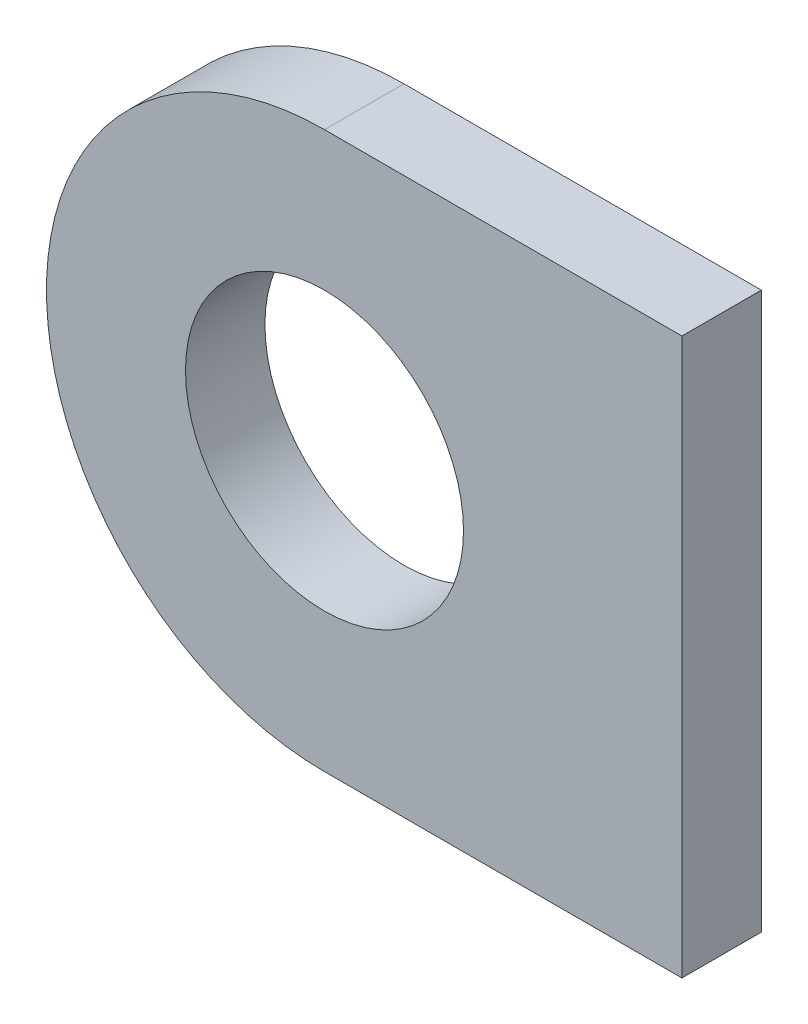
ISO-10303-21;
HEADER;
FILE_DESCRIPTION(('STEP AP214'),'2;1');
FILE_NAME('part.step','',(''),(''),'','','');
FILE_SCHEMA(('AUTOMOTIVE_DESIGN { 1 0 10303 214 1 1 1 1 }'));
ENDSEC;
DATA;
#1=APPLICATION_CONTEXT('core data for automotive mechanical design processes');
#2=APPLICATION_PROTOCOL_DEFINITION('international standard','automotive_design',2000,#1);
#3=PRODUCT_CONTEXT('',#1,'mechanical');
#4=PRODUCT('Part','Part','',(#3));
#5=PRODUCT_RELATED_PRODUCT_CATEGORY('part','',(#4));
#6=PRODUCT_DEFINITION_FORMATION('','',#4);
#7=PRODUCT_DEFINITION_CONTEXT('part definition',#1,'design');
#8=PRODUCT_DEFINITION('design','',#6,#7);
#9=PRODUCT_DEFINITION_SHAPE('','',#8);
#10=(LENGTH_UNIT() NAMED_UNIT(*) SI_UNIT(.MILLI.,.METRE.));
#11=(NAMED_UNIT(*) PLANE_ANGLE_UNIT() SI_UNIT($,.RADIAN.));
#12=(NAMED_UNIT(*) SI_UNIT($,.STERADIAN.) SOLID_ANGLE_UNIT());
#13=UNCERTAINTY_MEASURE_WITH_UNIT(LENGTH_MEASURE(1.E-05),#10,'distance_accuracy_value','');
#14=(GEOMETRIC_REPRESENTATION_CONTEXT(3) GLOBAL_UNCERTAINTY_ASSIGNED_CONTEXT((#13)) GLOBAL_UNIT_ASSIGNED_CONTEXT((#10,
#11,#12)) REPRESENTATION_CONTEXT('',''));
#15=CARTESIAN_POINT('',(0.,0.,0.));
#16=DIRECTION('',(0.,0.,1.));
#17=DIRECTION('',(1.,0.,0.));
#18=AXIS2_PLACEMENT_3D('',#15,#16,#17);
#19=CARTESIAN_POINT('',(-45.,-35.,10.));
#20=DIRECTION('',(0.,0.,-1.));
#21=DIRECTION('',(-1.,0.,0.));
#22=AXIS2_PLACEMENT_3D('',#19,#20,#21);
#23=PLANE('',#22);
#24=DIRECTION('',(0.,1.,0.));
#25=VECTOR('',#24,1.);
#26=CARTESIAN_POINT('',(0.,0.,10.));
#27=LINE('',#26,#25);
#28=CARTESIAN_POINT('',(0.,-70.,10.));
#29=VERTEX_POINT('',#28);
#30=CARTESIAN_POINT('',(0.,0.,10.));
#31=VERTEX_POINT('',#30);
#32=EDGE_CURVE('E84',#29,#31,#27,.T.);
#33=ORIENTED_EDGE('',*,*,#32,.T.);
#34=DIRECTION('',(-1.,0.,0.));
#35=VECTOR('',#34,1.);
#36=CARTESIAN_POINT('',(0.,0.,10.));
#37=LINE('',#36,#35);
#38=CARTESIAN_POINT('',(-45.,0.,10.));
#39=VERTEX_POINT('',#38);
#40=EDGE_CURVE('E79',#31,#39,#37,.T.);
#41=ORIENTED_EDGE('',*,*,#40,.T.);
#42=CARTESIAN_POINT('',(-45.,-35.,10.));
#43=DIRECTION('',(0.,0.,1.));
#44=DIRECTION('',(-1.,0.,0.));
#45=AXIS2_PLACEMENT_3D('',#42,#43,#44);
#46=CIRCLE('',#45,35.);
#47=CARTESIAN_POINT('',(-45.,-70.,10.));
#48=VERTEX_POINT('',#47);
#49=EDGE_CURVE('E82',#39,#48,#46,.T.);
#50=ORIENTED_EDGE('',*,*,#49,.T.);
#51=DIRECTION('',(1.,0.,0.));
#52=VECTOR('',#51,1.);
#53=CARTESIAN_POINT('',(0.,-70.,10.));
#54=LINE('',#53,#52);
#55=EDGE_CURVE('E49',#48,#29,#54,.T.);
#56=ORIENTED_EDGE('',*,*,#55,.T.);
#57=EDGE_LOOP('',(#33,#41,#50,#56));
#58=FACE_BOUND('',#57,.T.);
#59=CARTESIAN_POINT('',(-45.,-35.,10.));
#60=DIRECTION('',(0.,0.,1.));
#61=DIRECTION('',(1.,0.,0.));
#62=AXIS2_PLACEMENT_3D('',#59,#60,#61);
#63=CIRCLE('',#62,17.5);
#64=CARTESIAN_POINT('',(-27.5,-35.,10.));
#65=VERTEX_POINT('',#64);
#66=EDGE_CURVE('E99',#65,#65,#63,.T.);
#67=ORIENTED_EDGE('',*,*,#66,.F.);
#68=EDGE_LOOP('',(#67));
#69=FACE_BOUND('',#68,.T.);
#70=ADVANCED_FACE('F32',(#58,#69),#23,.F.);
#71=CARTESIAN_POINT('',(-45.,-35.,0.));
#72=DIRECTION('',(0.,0.,-1.));
#73=DIRECTION('',(-1.,0.,0.));
#74=AXIS2_PLACEMENT_3D('',#71,#72,#73);
#75=PLANE('',#74);
#76=DIRECTION('',(0.,1.,0.));
#77=VECTOR('',#76,1.);
#78=CARTESIAN_POINT('',(0.,0.,0.));
#79=LINE('',#78,#77);
#80=CARTESIAN_POINT('',(0.,-70.,0.));
#81=VERTEX_POINT('',#80);
#82=CARTESIAN_POINT('',(0.,0.,0.));
#83=VERTEX_POINT('',#82);
#84=EDGE_CURVE('E96',#81,#83,#79,.T.);
#85=ORIENTED_EDGE('',*,*,#84,.F.);
#86=DIRECTION('',(1.,0.,0.));
#87=VECTOR('',#86,1.);
#88=CARTESIAN_POINT('',(0.,-70.,0.));
#89=LINE('',#88,#87);
#90=CARTESIAN_POINT('',(-45.,-70.,0.));
#91=VERTEX_POINT('',#90);
#92=EDGE_CURVE('E72',#91,#81,#89,.T.);
#93=ORIENTED_EDGE('',*,*,#92,.F.);
#94=CARTESIAN_POINT('',(-45.,-35.,0.));
#95=DIRECTION('',(0.,0.,1.));
#96=DIRECTION('',(-1.,0.,0.));
#97=AXIS2_PLACEMENT_3D('',#94,#95,#96);
#98=CIRCLE('',#97,35.);
#99=CARTESIAN_POINT('',(-45.,0.,0.));
#100=VERTEX_POINT('',#99);
#101=EDGE_CURVE('E66',#100,#91,#98,.T.);
#102=ORIENTED_EDGE('',*,*,#101,.F.);
#103=DIRECTION('',(-1.,0.,0.));
#104=VECTOR('',#103,1.);
#105=CARTESIAN_POINT('',(0.,0.,0.));
#106=LINE('',#105,#104);
#107=EDGE_CURVE('E88',#83,#100,#106,.T.);
#108=ORIENTED_EDGE('',*,*,#107,.F.);
#109=EDGE_LOOP('',(#85,#93,#102,#108));
#110=FACE_BOUND('',#109,.T.);
#111=CARTESIAN_POINT('',(-45.,-35.,0.));
#112=DIRECTION('',(0.,0.,1.));
#113=DIRECTION('',(1.,0.,0.));
#114=AXIS2_PLACEMENT_3D('',#111,#112,#113);
#115=CIRCLE('',#114,17.5);
#116=CARTESIAN_POINT('',(-27.5,-35.,0.));
#117=VERTEX_POINT('',#116);
#118=EDGE_CURVE('E111',#117,#117,#115,.T.);
#119=ORIENTED_EDGE('',*,*,#118,.T.);
#120=EDGE_LOOP('',(#119));
#121=FACE_BOUND('',#120,.T.);
#122=ADVANCED_FACE('F107',(#110,#121),#75,.T.);
#123=CARTESIAN_POINT('',(0.,0.,10.));
#124=DIRECTION('',(-1.,0.,0.));
#125=DIRECTION('',(0.,-1.,0.));
#126=AXIS2_PLACEMENT_3D('',#123,#124,#125);
#127=PLANE('',#126);
#128=ORIENTED_EDGE('',*,*,#84,.T.);
#129=DIRECTION('',(0.,0.,-1.));
#130=VECTOR('',#129,1.);
#131=CARTESIAN_POINT('',(0.,0.,10.));
#132=LINE('',#131,#130);
#133=EDGE_CURVE('E11',#31,#83,#132,.T.);
#134=ORIENTED_EDGE('',*,*,#133,.F.);
#135=ORIENTED_EDGE('',*,*,#32,.F.);
#136=DIRECTION('',(0.,0.,-1.));
#137=VECTOR('',#136,1.);
#138=CARTESIAN_POINT('',(0.,-70.,10.));
#139=LINE('',#138,#137);
#140=EDGE_CURVE('E92',#29,#81,#139,.T.);
#141=ORIENTED_EDGE('',*,*,#140,.T.);
#142=EDGE_LOOP('',(#128,#134,#135,#141));
#143=FACE_BOUND('',#142,.T.);
#144=ADVANCED_FACE('F34',(#143),#127,.F.);
#145=CARTESIAN_POINT('',(0.,0.,10.));
#146=DIRECTION('',(0.,-1.,0.));
#147=DIRECTION('',(1.,0.,0.));
#148=AXIS2_PLACEMENT_3D('',#145,#146,#147);
#149=PLANE('',#148);
#150=ORIENTED_EDGE('',*,*,#107,.T.);
#151=DIRECTION('',(0.,0.,-1.));
#152=VECTOR('',#151,1.);
#153=CARTESIAN_POINT('',(-45.,0.,10.));
#154=LINE('',#153,#152);
#155=EDGE_CURVE('E41',#39,#100,#154,.T.);
#156=ORIENTED_EDGE('',*,*,#155,.F.);
#157=ORIENTED_EDGE('',*,*,#40,.F.);
#158=ORIENTED_EDGE('',*,*,#133,.T.);
#159=EDGE_LOOP('',(#150,#156,#157,#158));
#160=FACE_BOUND('',#159,.T.);
#161=ADVANCED_FACE('F87',(#160),#149,.F.);
#162=CARTESIAN_POINT('',(-45.,-35.,10.));
#163=DIRECTION('',(0.,0.,-1.));
#164=DIRECTION('',(-1.,0.,0.));
#165=AXIS2_PLACEMENT_3D('',#162,#163,#164);
#166=CYLINDRICAL_SURFACE('',#165,35.);
#167=ORIENTED_EDGE('',*,*,#101,.T.);
#168=DIRECTION('',(0.,0.,-1.));
#169=VECTOR('',#168,1.);
#170=CARTESIAN_POINT('',(-45.,-70.,10.));
#171=LINE('',#170,#169);
#172=EDGE_CURVE('E89',#48,#91,#171,.T.);
#173=ORIENTED_EDGE('',*,*,#172,.F.);
#174=ORIENTED_EDGE('',*,*,#49,.F.);
#175=ORIENTED_EDGE('',*,*,#155,.T.);
#176=EDGE_LOOP('',(#167,#173,#174,#175));
#177=FACE_BOUND('',#176,.T.);
#178=ADVANCED_FACE('F90',(#177),#166,.T.);
#179=CARTESIAN_POINT('',(0.,-70.,10.));
#180=DIRECTION('',(0.,1.,0.));
#181=DIRECTION('',(0.,0.,1.));
#182=AXIS2_PLACEMENT_3D('',#179,#180,#181);
#183=PLANE('',#182);
#184=ORIENTED_EDGE('',*,*,#92,.T.);
#185=ORIENTED_EDGE('',*,*,#140,.F.);
#186=ORIENTED_EDGE('',*,*,#55,.F.);
#187=ORIENTED_EDGE('',*,*,#172,.T.);
#188=EDGE_LOOP('',(#184,#185,#186,#187));
#189=FACE_BOUND('',#188,.T.);
#190=ADVANCED_FACE('F104',(#189),#183,.F.);
#191=CARTESIAN_POINT('',(-45.,-35.,10.));
#192=DIRECTION('',(0.,0.,-1.));
#193=DIRECTION('',(-1.,0.,0.));
#194=AXIS2_PLACEMENT_3D('',#191,#192,#193);
#195=CYLINDRICAL_SURFACE('',#194,17.5);
#196=ORIENTED_EDGE('',*,*,#66,.T.);
#197=EDGE_LOOP('',(#196));
#198=FACE_BOUND('',#197,.T.);
#199=ORIENTED_EDGE('',*,*,#118,.F.);
#200=EDGE_LOOP('',(#199));
#201=FACE_BOUND('',#200,.T.);
#202=ADVANCED_FACE('F117',(#198,#201),#195,.F.);
#203=CLOSED_SHELL('',(#70,#122,#144,#161,#178,#190,#202));
#204=MANIFOLD_SOLID_BREP('B2',#203);
#205=ADVANCED_BREP_SHAPE_REPRESENTATION('',(#18,#204),#14);
#206=SHAPE_DEFINITION_REPRESENTATION(#9,#205);
ENDSEC;
END-ISO-10303-21;
